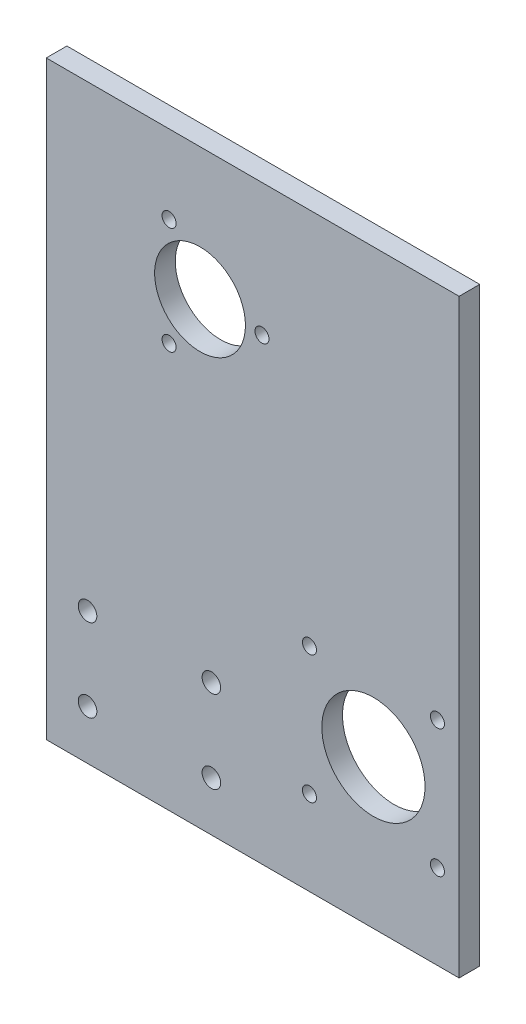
from build123d import *

# Parameters (mm, degrees)
SCHIZZO1_W                   = 100
SCHIZZO1_H                   = 140
ESTRUSIONE_ESTRUSIONE1_DEPTH = 5
FORO_PER_VITE_M4_1_D         = 4.5
FORO_PER_VITE_M3_2_D         = 3.4
SCHIZZO7_R                   = 11
TAGLIO_ESTRUSIONE1_DEPTH     = 87.168439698
SCHIZZO8_R                   = 12.5
TAGLIO_ESTRUSIONE2_DEPTH     = 87.168439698
SCHIZZO13_W                  = 100
SCHIZZO13_H                  = 5
ESTRUSIONE_ESTRUSIONE3_DEPTH = 3


with BuildPart() as part:
    # Schizzo1 → Estrusione-Estrusione1 (new body)
    with BuildSketch(Plane.XY):
        Rectangle(SCHIZZO1_W, SCHIZZO1_H)
    extrude(amount=ESTRUSIONE_ESTRUSIONE1_DEPTH)

    # Foro per Vite M4-1 (through all)
    with Locations(Plane.XY.offset(5)):
        with Locations((-40, -38), (-10, -38), (-40, -58), (-10, -58)):
            Hole(FORO_PER_VITE_M4_1_D / 2)

    # Foro per Vite M3-2 (through all)
    with Locations(Plane.XY.offset(5)):
        with Locations((13.75, -18.5), (44.75, -18.5), (13.75, -49.5), (44.75, -49.5), (-20.25, 53.990381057), (2.25, 41), (-20.25, 28.009618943)):
            Hole(FORO_PER_VITE_M3_2_D / 2)

    # Schizzo7 → Taglio-Estrusione1 (cut, through all)
    with BuildSketch(Plane.XY.offset(5)):
        with Locations((-12.75, 41)):
            Circle(SCHIZZO7_R)
    extrude(amount=-TAGLIO_ESTRUSIONE1_DEPTH, mode=Mode.SUBTRACT)

    # Schizzo8 → Taglio-Estrusione2 (cut, through all)
    with BuildSketch(Plane.XY.offset(5)):
        with Locations((29.25, -34)):
            Circle(SCHIZZO8_R)
    extrude(amount=-TAGLIO_ESTRUSIONE2_DEPTH, mode=Mode.SUBTRACT)

    # Schizzo13 → Estrusione-Estrusione3 (add)
    with BuildSketch(Plane(origin=(0, 70, 0), x_dir=(1, 0, 0), z_dir=(0, 1, 0))):
        with Locations((0, -2.5)):
            Rectangle(SCHIZZO13_W, SCHIZZO13_H)
    extrude(amount=ESTRUSIONE_ESTRUSIONE3_DEPTH)


solid = part.part
